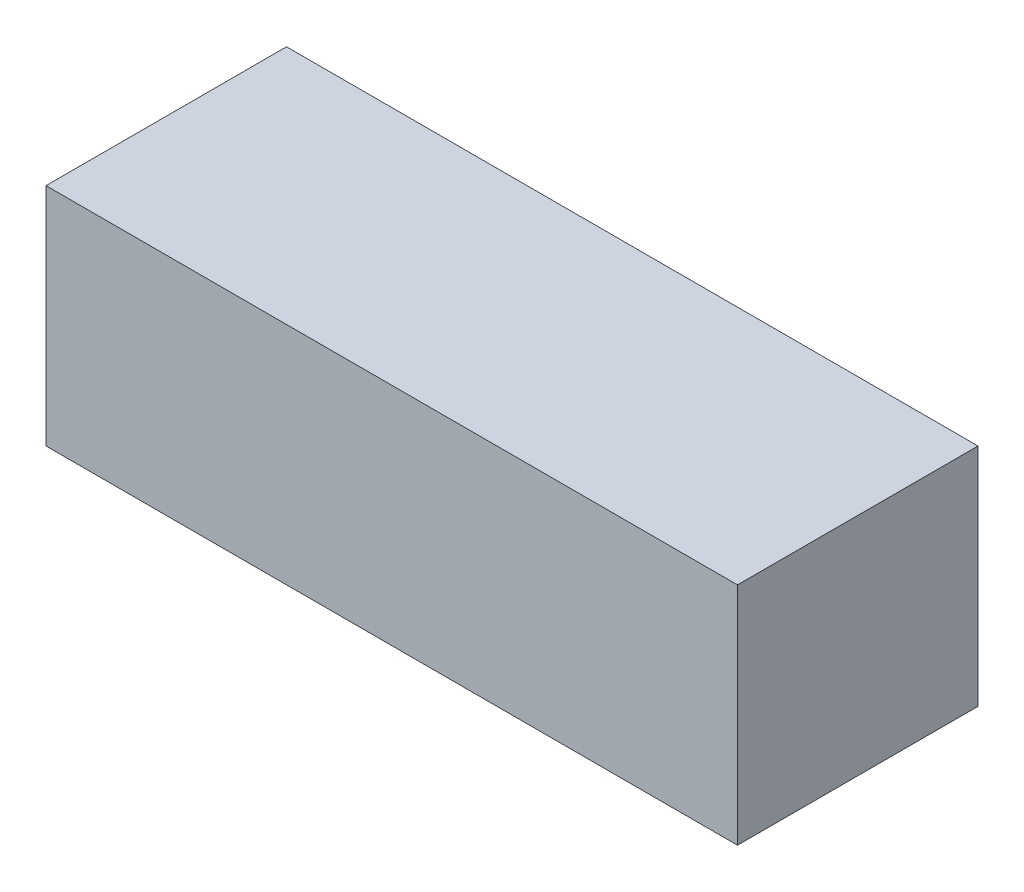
ISO-10303-21;
HEADER;
FILE_DESCRIPTION(('STEP AP214'),'2;1');
FILE_NAME('part.step','',(''),(''),'','','');
FILE_SCHEMA(('AUTOMOTIVE_DESIGN { 1 0 10303 214 1 1 1 1 }'));
ENDSEC;
DATA;
#1=APPLICATION_CONTEXT('core data for automotive mechanical design processes');
#2=APPLICATION_PROTOCOL_DEFINITION('international standard','automotive_design',2000,#1);
#3=PRODUCT_CONTEXT('',#1,'mechanical');
#4=PRODUCT('Part','Part','',(#3));
#5=PRODUCT_RELATED_PRODUCT_CATEGORY('part','',(#4));
#6=PRODUCT_DEFINITION_FORMATION('','',#4);
#7=PRODUCT_DEFINITION_CONTEXT('part definition',#1,'design');
#8=PRODUCT_DEFINITION('design','',#6,#7);
#9=PRODUCT_DEFINITION_SHAPE('','',#8);
#10=(LENGTH_UNIT() NAMED_UNIT(*) SI_UNIT(.MILLI.,.METRE.));
#11=(NAMED_UNIT(*) PLANE_ANGLE_UNIT() SI_UNIT($,.RADIAN.));
#12=(NAMED_UNIT(*) SI_UNIT($,.STERADIAN.) SOLID_ANGLE_UNIT());
#13=UNCERTAINTY_MEASURE_WITH_UNIT(LENGTH_MEASURE(1.E-05),#10,'distance_accuracy_value','');
#14=(GEOMETRIC_REPRESENTATION_CONTEXT(3) GLOBAL_UNCERTAINTY_ASSIGNED_CONTEXT((#13)) GLOBAL_UNIT_ASSIGNED_CONTEXT((#10,
#11,#12)) REPRESENTATION_CONTEXT('',''));
#15=CARTESIAN_POINT('',(0.,0.,0.));
#16=DIRECTION('',(0.,0.,1.));
#17=DIRECTION('',(1.,0.,0.));
#18=AXIS2_PLACEMENT_3D('',#15,#16,#17);
#19=CARTESIAN_POINT('',(115.,37.5,-57.5));
#20=DIRECTION('',(-1.,0.,0.));
#21=DIRECTION('',(0.,0.,1.));
#22=AXIS2_PLACEMENT_3D('',#19,#20,#21);
#23=PLANE('',#22);
#24=DIRECTION('',(0.,0.,-1.));
#25=VECTOR('',#24,1.);
#26=CARTESIAN_POINT('',(115.,-37.5,-57.5));
#27=LINE('',#26,#25);
#28=CARTESIAN_POINT('',(115.,-37.5,57.5));
#29=VERTEX_POINT('',#28);
#30=CARTESIAN_POINT('',(115.,-37.5,-22.5));
#31=VERTEX_POINT('',#30);
#32=EDGE_CURVE('E88',#29,#31,#27,.T.);
#33=ORIENTED_EDGE('',*,*,#32,.T.);
#34=DIRECTION('',(0.,-1.,0.));
#35=VECTOR('',#34,1.);
#36=CARTESIAN_POINT('',(115.,37.5,-22.5));
#37=LINE('',#36,#35);
#38=CARTESIAN_POINT('',(115.,37.5,-22.5));
#39=VERTEX_POINT('',#38);
#40=EDGE_CURVE('E53',#39,#31,#37,.T.);
#41=ORIENTED_EDGE('',*,*,#40,.F.);
#42=DIRECTION('',(0.,0.,-1.));
#43=VECTOR('',#42,1.);
#44=CARTESIAN_POINT('',(115.,37.5,-57.5));
#45=LINE('',#44,#43);
#46=CARTESIAN_POINT('',(115.,37.5,57.5));
#47=VERTEX_POINT('',#46);
#48=EDGE_CURVE('E83',#47,#39,#45,.T.);
#49=ORIENTED_EDGE('',*,*,#48,.F.);
#50=DIRECTION('',(0.,-1.,0.));
#51=VECTOR('',#50,1.);
#52=CARTESIAN_POINT('',(115.,37.5,57.5));
#53=LINE('',#52,#51);
#54=EDGE_CURVE('E46',#47,#29,#53,.T.);
#55=ORIENTED_EDGE('',*,*,#54,.T.);
#56=EDGE_LOOP('',(#33,#41,#49,#55));
#57=FACE_BOUND('',#56,.T.);
#58=ADVANCED_FACE('F38',(#57),#23,.F.);
#59=CARTESIAN_POINT('',(-115.,37.5,-57.5));
#60=DIRECTION('',(1.,0.,0.));
#61=DIRECTION('',(0.,0.,-1.));
#62=AXIS2_PLACEMENT_3D('',#59,#60,#61);
#63=PLANE('',#62);
#64=DIRECTION('',(0.,0.,1.));
#65=VECTOR('',#64,1.);
#66=CARTESIAN_POINT('',(-115.,37.5,-57.5));
#67=LINE('',#66,#65);
#68=CARTESIAN_POINT('',(-115.,37.5,-22.5));
#69=VERTEX_POINT('',#68);
#70=CARTESIAN_POINT('',(-115.,37.5,57.5));
#71=VERTEX_POINT('',#70);
#72=EDGE_CURVE('E103',#69,#71,#67,.T.);
#73=ORIENTED_EDGE('',*,*,#72,.F.);
#74=DIRECTION('',(0.,1.,0.));
#75=VECTOR('',#74,1.);
#76=CARTESIAN_POINT('',(-115.,37.5,-22.5));
#77=LINE('',#76,#75);
#78=CARTESIAN_POINT('',(-115.,-37.5,-22.5));
#79=VERTEX_POINT('',#78);
#80=EDGE_CURVE('E93',#79,#69,#77,.T.);
#81=ORIENTED_EDGE('',*,*,#80,.F.);
#82=DIRECTION('',(0.,0.,1.));
#83=VECTOR('',#82,1.);
#84=CARTESIAN_POINT('',(-115.,-37.5,-57.5));
#85=LINE('',#84,#83);
#86=CARTESIAN_POINT('',(-115.,-37.5,57.5));
#87=VERTEX_POINT('',#86);
#88=EDGE_CURVE('E84',#79,#87,#85,.T.);
#89=ORIENTED_EDGE('',*,*,#88,.T.);
#90=DIRECTION('',(0.,-1.,0.));
#91=VECTOR('',#90,1.);
#92=CARTESIAN_POINT('',(-115.,37.5,57.5));
#93=LINE('',#92,#91);
#94=EDGE_CURVE('E11',#71,#87,#93,.T.);
#95=ORIENTED_EDGE('',*,*,#94,.F.);
#96=EDGE_LOOP('',(#73,#81,#89,#95));
#97=FACE_BOUND('',#96,.T.);
#98=ADVANCED_FACE('F130',(#97),#63,.F.);
#99=CARTESIAN_POINT('',(-115.,37.5,57.5));
#100=DIRECTION('',(0.,0.,-1.));
#101=DIRECTION('',(-1.,0.,0.));
#102=AXIS2_PLACEMENT_3D('',#99,#100,#101);
#103=PLANE('',#102);
#104=DIRECTION('',(1.,0.,0.));
#105=VECTOR('',#104,1.);
#106=CARTESIAN_POINT('',(-115.,-37.5,57.5));
#107=LINE('',#106,#105);
#108=EDGE_CURVE('E74',#87,#29,#107,.T.);
#109=ORIENTED_EDGE('',*,*,#108,.T.);
#110=ORIENTED_EDGE('',*,*,#54,.F.);
#111=DIRECTION('',(1.,0.,0.));
#112=VECTOR('',#111,1.);
#113=CARTESIAN_POINT('',(-115.,37.5,57.5));
#114=LINE('',#113,#112);
#115=EDGE_CURVE('E62',#71,#47,#114,.T.);
#116=ORIENTED_EDGE('',*,*,#115,.F.);
#117=ORIENTED_EDGE('',*,*,#94,.T.);
#118=EDGE_LOOP('',(#109,#110,#116,#117));
#119=FACE_BOUND('',#118,.T.);
#120=ADVANCED_FACE('F76',(#119),#103,.F.);
#121=CARTESIAN_POINT('',(0.,37.5,0.));
#122=DIRECTION('',(0.,1.,0.));
#123=DIRECTION('',(0.,0.,1.));
#124=AXIS2_PLACEMENT_3D('',#121,#122,#123);
#125=PLANE('',#124);
#126=DIRECTION('',(1.,0.,0.));
#127=VECTOR('',#126,1.);
#128=CARTESIAN_POINT('',(115.,37.5,-22.5));
#129=LINE('',#128,#127);
#130=EDGE_CURVE('E112',#69,#39,#129,.T.);
#131=ORIENTED_EDGE('',*,*,#130,.F.);
#132=ORIENTED_EDGE('',*,*,#72,.T.);
#133=ORIENTED_EDGE('',*,*,#115,.T.);
#134=ORIENTED_EDGE('',*,*,#48,.T.);
#135=EDGE_LOOP('',(#131,#132,#133,#134));
#136=FACE_BOUND('',#135,.T.);
#137=ADVANCED_FACE('F121',(#136),#125,.T.);
#138=CARTESIAN_POINT('',(0.,-37.5,0.));
#139=DIRECTION('',(0.,1.,0.));
#140=DIRECTION('',(0.,0.,1.));
#141=AXIS2_PLACEMENT_3D('',#138,#139,#140);
#142=PLANE('',#141);
#143=ORIENTED_EDGE('',*,*,#88,.F.);
#144=DIRECTION('',(-1.,0.,0.));
#145=VECTOR('',#144,1.);
#146=CARTESIAN_POINT('',(115.,-37.5,-22.5));
#147=LINE('',#146,#145);
#148=EDGE_CURVE('E91',#31,#79,#147,.T.);
#149=ORIENTED_EDGE('',*,*,#148,.F.);
#150=ORIENTED_EDGE('',*,*,#32,.F.);
#151=ORIENTED_EDGE('',*,*,#108,.F.);
#152=EDGE_LOOP('',(#143,#149,#150,#151));
#153=FACE_BOUND('',#152,.T.);
#154=ADVANCED_FACE('F90',(#153),#142,.F.);
#155=CARTESIAN_POINT('',(0.,0.,-22.5));
#156=DIRECTION('',(0.,0.,1.));
#157=DIRECTION('',(1.,0.,0.));
#158=AXIS2_PLACEMENT_3D('',#155,#156,#157);
#159=PLANE('',#158);
#160=ORIENTED_EDGE('',*,*,#130,.T.);
#161=ORIENTED_EDGE('',*,*,#40,.T.);
#162=ORIENTED_EDGE('',*,*,#148,.T.);
#163=ORIENTED_EDGE('',*,*,#80,.T.);
#164=EDGE_LOOP('',(#160,#161,#162,#163));
#165=FACE_BOUND('',#164,.T.);
#166=ADVANCED_FACE('F116',(#165),#159,.F.);
#167=CLOSED_SHELL('',(#58,#98,#120,#137,#154,#166));
#168=MANIFOLD_SOLID_BREP('B2',#167);
#169=ADVANCED_BREP_SHAPE_REPRESENTATION('',(#18,#168),#14);
#170=SHAPE_DEFINITION_REPRESENTATION(#9,#169);
ENDSEC;
END-ISO-10303-21;
